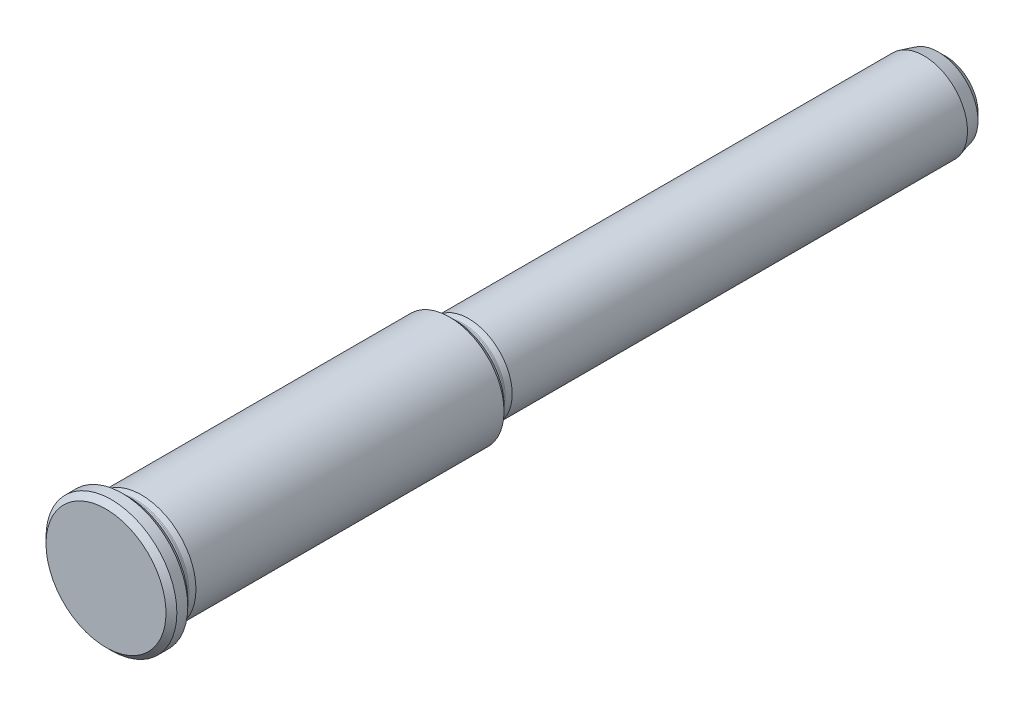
ISO-10303-21;
HEADER;
FILE_DESCRIPTION(('STEP AP214'),'2;1');
FILE_NAME('part.step','',(''),(''),'','','');
FILE_SCHEMA(('AUTOMOTIVE_DESIGN { 1 0 10303 214 1 1 1 1 }'));
ENDSEC;
DATA;
#1=APPLICATION_CONTEXT('core data for automotive mechanical design processes');
#2=APPLICATION_PROTOCOL_DEFINITION('international standard','automotive_design',2000,#1);
#3=PRODUCT_CONTEXT('',#1,'mechanical');
#4=PRODUCT('Part','Part','',(#3));
#5=PRODUCT_RELATED_PRODUCT_CATEGORY('part','',(#4));
#6=PRODUCT_DEFINITION_FORMATION('','',#4);
#7=PRODUCT_DEFINITION_CONTEXT('part definition',#1,'design');
#8=PRODUCT_DEFINITION('design','',#6,#7);
#9=PRODUCT_DEFINITION_SHAPE('','',#8);
#10=(LENGTH_UNIT() NAMED_UNIT(*) SI_UNIT(.MILLI.,.METRE.));
#11=(NAMED_UNIT(*) PLANE_ANGLE_UNIT() SI_UNIT($,.RADIAN.));
#12=(NAMED_UNIT(*) SI_UNIT($,.STERADIAN.) SOLID_ANGLE_UNIT());
#13=UNCERTAINTY_MEASURE_WITH_UNIT(LENGTH_MEASURE(1.E-05),#10,'distance_accuracy_value','');
#14=(GEOMETRIC_REPRESENTATION_CONTEXT(3) GLOBAL_UNCERTAINTY_ASSIGNED_CONTEXT((#13)) GLOBAL_UNIT_ASSIGNED_CONTEXT((#10,
#11,#12)) REPRESENTATION_CONTEXT('',''));
#15=CARTESIAN_POINT('',(0.,0.,0.));
#16=DIRECTION('',(0.,0.,1.));
#17=DIRECTION('',(1.,0.,0.));
#18=AXIS2_PLACEMENT_3D('',#15,#16,#17);
#19=CARTESIAN_POINT('',(0.,0.,0.));
#20=DIRECTION('',(0.,0.,-1.));
#21=DIRECTION('',(-1.,0.,0.));
#22=AXIS2_PLACEMENT_3D('',#19,#20,#21);
#23=PLANE('',#22);
#24=CARTESIAN_POINT('',(0.,0.,0.));
#25=DIRECTION('',(0.,0.,-1.));
#26=DIRECTION('',(-1.,0.,0.));
#27=AXIS2_PLACEMENT_3D('',#24,#25,#26);
#28=CIRCLE('',#27,11.);
#29=CARTESIAN_POINT('',(-11.,0.,0.));
#30=VERTEX_POINT('',#29);
#31=EDGE_CURVE('E9',#30,#30,#28,.F.);
#32=ORIENTED_EDGE('',*,*,#31,.T.);
#33=EDGE_LOOP('',(#32));
#34=FACE_BOUND('',#33,.T.);
#35=ADVANCED_FACE('F14',(#34),#23,.F.);
#36=CARTESIAN_POINT('',(0.,0.,0.));
#37=DIRECTION('',(0.,0.,1.));
#38=DIRECTION('',(1.,0.,0.));
#39=AXIS2_PLACEMENT_3D('',#36,#37,#38);
#40=CYLINDRICAL_SURFACE('',#39,12.);
#41=CARTESIAN_POINT('',(0.,0.,-3.));
#42=DIRECTION('',(0.,0.,1.));
#43=DIRECTION('',(1.,0.,0.));
#44=AXIS2_PLACEMENT_3D('',#41,#42,#43);
#45=CIRCLE('',#44,12.);
#46=CARTESIAN_POINT('',(12.,0.,-3.));
#47=VERTEX_POINT('',#46);
#48=EDGE_CURVE('E25',#47,#47,#45,.T.);
#49=ORIENTED_EDGE('',*,*,#48,.T.);
#50=EDGE_LOOP('',(#49));
#51=FACE_BOUND('',#50,.T.);
#52=CARTESIAN_POINT('',(0.,0.,-1.));
#53=DIRECTION('',(0.,0.,-1.));
#54=DIRECTION('',(-1.,0.,0.));
#55=AXIS2_PLACEMENT_3D('',#52,#53,#54);
#56=CIRCLE('',#55,12.);
#57=CARTESIAN_POINT('',(-12.,0.,-1.));
#58=VERTEX_POINT('',#57);
#59=EDGE_CURVE('E29',#58,#58,#56,.T.);
#60=ORIENTED_EDGE('',*,*,#59,.T.);
#61=EDGE_LOOP('',(#60));
#62=FACE_BOUND('',#61,.T.);
#63=ADVANCED_FACE('F100',(#51,#62),#40,.T.);
#64=CARTESIAN_POINT('',(0.,12.,-4.));
#65=DIRECTION('',(0.,0.,1.));
#66=DIRECTION('',(1.,0.,0.));
#67=AXIS2_PLACEMENT_3D('',#64,#65,#66);
#68=PLANE('',#67);
#69=CARTESIAN_POINT('',(0.,0.,-4.));
#70=DIRECTION('',(0.,0.,1.));
#71=DIRECTION('',(1.,0.,0.));
#72=AXIS2_PLACEMENT_3D('',#69,#70,#71);
#73=CIRCLE('',#72,11.);
#74=CARTESIAN_POINT('',(11.,0.,-4.));
#75=VERTEX_POINT('',#74);
#76=EDGE_CURVE('E21',#75,#75,#73,.F.);
#77=ORIENTED_EDGE('',*,*,#76,.T.);
#78=EDGE_LOOP('',(#77));
#79=FACE_BOUND('',#78,.T.);
#80=CARTESIAN_POINT('',(0.,0.,-4.));
#81=DIRECTION('',(0.,0.,1.));
#82=DIRECTION('',(1.,0.,0.));
#83=AXIS2_PLACEMENT_3D('',#80,#81,#82);
#84=CIRCLE('',#83,10.5);
#85=CARTESIAN_POINT('',(10.5,0.,-4.));
#86=VERTEX_POINT('',#85);
#87=EDGE_CURVE('E46',#86,#86,#84,.T.);
#88=ORIENTED_EDGE('',*,*,#87,.T.);
#89=EDGE_LOOP('',(#88));
#90=FACE_BOUND('',#89,.T.);
#91=ADVANCED_FACE('F106',(#79,#90),#68,.F.);
#92=CARTESIAN_POINT('',(0.,0.,-4.8));
#93=DIRECTION('',(0.,0.,1.));
#94=DIRECTION('',(1.,0.,0.));
#95=AXIS2_PLACEMENT_3D('',#92,#93,#94);
#96=TOROIDAL_SURFACE('',#95,10.5,0.8);
#97=ORIENTED_EDGE('',*,*,#87,.F.);
#98=EDGE_LOOP('',(#97));
#99=FACE_BOUND('',#98,.T.);
#100=CARTESIAN_POINT('',(0.,0.,-4.8));
#101=DIRECTION('',(0.,0.,1.));
#102=DIRECTION('',(1.,0.,0.));
#103=AXIS2_PLACEMENT_3D('',#100,#101,#102);
#104=CIRCLE('',#103,9.7);
#105=CARTESIAN_POINT('',(9.7,0.,-4.8));
#106=VERTEX_POINT('',#105);
#107=EDGE_CURVE('E49',#106,#106,#104,.T.);
#108=ORIENTED_EDGE('',*,*,#107,.T.);
#109=EDGE_LOOP('',(#108));
#110=FACE_BOUND('',#109,.T.);
#111=ADVANCED_FACE('F176',(#99,#110),#96,.F.);
#112=CARTESIAN_POINT('',(0.,0.,0.));
#113=DIRECTION('',(0.,0.,1.));
#114=DIRECTION('',(1.,0.,0.));
#115=AXIS2_PLACEMENT_3D('',#112,#113,#114);
#116=CYLINDRICAL_SURFACE('',#115,9.7);
#117=ORIENTED_EDGE('',*,*,#107,.F.);
#118=EDGE_LOOP('',(#117));
#119=FACE_BOUND('',#118,.T.);
#120=CARTESIAN_POINT('',(0.,0.,-5.27506275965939));
#121=DIRECTION('',(0.,0.,1.));
#122=DIRECTION('',(1.,0.,0.));
#123=AXIS2_PLACEMENT_3D('',#120,#121,#122);
#124=CIRCLE('',#123,9.7);
#125=CARTESIAN_POINT('',(9.7,0.,-5.27506275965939));
#126=VERTEX_POINT('',#125);
#127=EDGE_CURVE('E52',#126,#126,#124,.T.);
#128=ORIENTED_EDGE('',*,*,#127,.T.);
#129=EDGE_LOOP('',(#128));
#130=FACE_BOUND('',#129,.T.);
#131=ADVANCED_FACE('F232',(#119,#130),#116,.T.);
#132=CARTESIAN_POINT('',(0.,0.,-5.27506275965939));
#133=DIRECTION('',(0.,0.,1.));
#134=DIRECTION('',(1.,0.,0.));
#135=AXIS2_PLACEMENT_3D('',#132,#133,#134);
#136=TOROIDAL_SURFACE('',#135,10.5,0.8);
#137=ORIENTED_EDGE('',*,*,#127,.F.);
#138=EDGE_LOOP('',(#137));
#139=FACE_BOUND('',#138,.T.);
#140=CARTESIAN_POINT('',(0.,0.,-5.4821179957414));
#141=DIRECTION('',(0.,0.,1.));
#142=DIRECTION('',(1.,0.,0.));
#143=AXIS2_PLACEMENT_3D('',#140,#141,#142);
#144=CIRCLE('',#143,9.72725933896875);
#145=CARTESIAN_POINT('',(9.72725933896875,0.,-5.4821179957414));
#146=VERTEX_POINT('',#145);
#147=EDGE_CURVE('E55',#146,#146,#144,.T.);
#148=ORIENTED_EDGE('',*,*,#147,.T.);
#149=EDGE_LOOP('',(#148));
#150=FACE_BOUND('',#149,.T.);
#151=ADVANCED_FACE('F222',(#139,#150),#136,.F.);
#152=CARTESIAN_POINT('',(0.,0.,-6.5));
#153=DIRECTION('',(0.,0.,-1.));
#154=DIRECTION('',(-1.,0.,0.));
#155=AXIS2_PLACEMENT_3D('',#152,#153,#154);
#156=CONICAL_SURFACE('',#155,10.,0.261799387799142);
#157=ORIENTED_EDGE('',*,*,#147,.F.);
#158=EDGE_LOOP('',(#157));
#159=FACE_BOUND('',#158,.T.);
#160=CARTESIAN_POINT('',(0.,0.,-6.5));
#161=DIRECTION('',(0.,0.,1.));
#162=DIRECTION('',(1.,0.,0.));
#163=AXIS2_PLACEMENT_3D('',#160,#161,#162);
#164=CIRCLE('',#163,10.);
#165=CARTESIAN_POINT('',(10.,0.,-6.5));
#166=VERTEX_POINT('',#165);
#167=EDGE_CURVE('E58',#166,#166,#164,.T.);
#168=ORIENTED_EDGE('',*,*,#167,.T.);
#169=EDGE_LOOP('',(#168));
#170=FACE_BOUND('',#169,.T.);
#171=ADVANCED_FACE('F164',(#159,#170),#156,.T.);
#172=CARTESIAN_POINT('',(0.,0.,0.));
#173=DIRECTION('',(0.,0.,1.));
#174=DIRECTION('',(1.,0.,0.));
#175=AXIS2_PLACEMENT_3D('',#172,#173,#174);
#176=CYLINDRICAL_SURFACE('',#175,10.);
#177=CARTESIAN_POINT('',(0.,0.,-63.));
#178=DIRECTION('',(0.,0.,1.));
#179=DIRECTION('',(1.,0.,0.));
#180=AXIS2_PLACEMENT_3D('',#177,#178,#179);
#181=CIRCLE('',#180,10.);
#182=CARTESIAN_POINT('',(10.,0.,-63.));
#183=VERTEX_POINT('',#182);
#184=EDGE_CURVE('E37',#183,#183,#181,.T.);
#185=ORIENTED_EDGE('',*,*,#184,.T.);
#186=EDGE_LOOP('',(#185));
#187=FACE_BOUND('',#186,.T.);
#188=ORIENTED_EDGE('',*,*,#167,.F.);
#189=EDGE_LOOP('',(#188));
#190=FACE_BOUND('',#189,.T.);
#191=ADVANCED_FACE('F152',(#187,#190),#176,.T.);
#192=CARTESIAN_POINT('',(0.,10.,-64.));
#193=DIRECTION('',(0.,0.,1.));
#194=DIRECTION('',(1.,0.,0.));
#195=AXIS2_PLACEMENT_3D('',#192,#193,#194);
#196=PLANE('',#195);
#197=CARTESIAN_POINT('',(0.,0.,-64.));
#198=DIRECTION('',(0.,0.,1.));
#199=DIRECTION('',(1.,0.,0.));
#200=AXIS2_PLACEMENT_3D('',#197,#198,#199);
#201=CIRCLE('',#200,9.);
#202=CARTESIAN_POINT('',(9.,0.,-64.));
#203=VERTEX_POINT('',#202);
#204=EDGE_CURVE('E34',#203,#203,#201,.F.);
#205=ORIENTED_EDGE('',*,*,#204,.T.);
#206=EDGE_LOOP('',(#205));
#207=FACE_BOUND('',#206,.T.);
#208=CARTESIAN_POINT('',(0.,0.,-64.));
#209=DIRECTION('',(0.,0.,1.));
#210=DIRECTION('',(1.,0.,0.));
#211=AXIS2_PLACEMENT_3D('',#208,#209,#210);
#212=CIRCLE('',#211,8.5);
#213=CARTESIAN_POINT('',(8.5,0.,-64.));
#214=VERTEX_POINT('',#213);
#215=EDGE_CURVE('E61',#214,#214,#212,.T.);
#216=ORIENTED_EDGE('',*,*,#215,.T.);
#217=EDGE_LOOP('',(#216));
#218=FACE_BOUND('',#217,.T.);
#219=ADVANCED_FACE('F146',(#207,#218),#196,.F.);
#220=CARTESIAN_POINT('',(0.,0.,-64.8));
#221=DIRECTION('',(0.,0.,1.));
#222=DIRECTION('',(1.,0.,0.));
#223=AXIS2_PLACEMENT_3D('',#220,#221,#222);
#224=TOROIDAL_SURFACE('',#223,8.5,0.8);
#225=ORIENTED_EDGE('',*,*,#215,.F.);
#226=EDGE_LOOP('',(#225));
#227=FACE_BOUND('',#226,.T.);
#228=CARTESIAN_POINT('',(0.,0.,-64.8));
#229=DIRECTION('',(0.,0.,1.));
#230=DIRECTION('',(1.,0.,0.));
#231=AXIS2_PLACEMENT_3D('',#228,#229,#230);
#232=CIRCLE('',#231,7.7);
#233=CARTESIAN_POINT('',(7.7,0.,-64.8));
#234=VERTEX_POINT('',#233);
#235=EDGE_CURVE('E64',#234,#234,#232,.T.);
#236=ORIENTED_EDGE('',*,*,#235,.T.);
#237=EDGE_LOOP('',(#236));
#238=FACE_BOUND('',#237,.T.);
#239=ADVANCED_FACE('F151',(#227,#238),#224,.F.);
#240=CARTESIAN_POINT('',(0.,0.,0.));
#241=DIRECTION('',(0.,0.,1.));
#242=DIRECTION('',(1.,0.,0.));
#243=AXIS2_PLACEMENT_3D('',#240,#241,#242);
#244=CYLINDRICAL_SURFACE('',#243,7.7);
#245=ORIENTED_EDGE('',*,*,#235,.F.);
#246=EDGE_LOOP('',(#245));
#247=FACE_BOUND('',#246,.T.);
#248=CARTESIAN_POINT('',(0.,0.,-65.2750627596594));
#249=DIRECTION('',(0.,0.,1.));
#250=DIRECTION('',(1.,0.,0.));
#251=AXIS2_PLACEMENT_3D('',#248,#249,#250);
#252=CIRCLE('',#251,7.7);
#253=CARTESIAN_POINT('',(7.7,0.,-65.2750627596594));
#254=VERTEX_POINT('',#253);
#255=EDGE_CURVE('E67',#254,#254,#252,.T.);
#256=ORIENTED_EDGE('',*,*,#255,.T.);
#257=EDGE_LOOP('',(#256));
#258=FACE_BOUND('',#257,.T.);
#259=ADVANCED_FACE('F198',(#247,#258),#244,.T.);
#260=CARTESIAN_POINT('',(0.,0.,-65.2750627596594));
#261=DIRECTION('',(0.,0.,1.));
#262=DIRECTION('',(1.,0.,0.));
#263=AXIS2_PLACEMENT_3D('',#260,#261,#262);
#264=TOROIDAL_SURFACE('',#263,8.5,0.8);
#265=ORIENTED_EDGE('',*,*,#255,.F.);
#266=EDGE_LOOP('',(#265));
#267=FACE_BOUND('',#266,.T.);
#268=CARTESIAN_POINT('',(0.,0.,-65.4821179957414));
#269=DIRECTION('',(0.,0.,1.));
#270=DIRECTION('',(1.,0.,0.));
#271=AXIS2_PLACEMENT_3D('',#268,#269,#270);
#272=CIRCLE('',#271,7.72725933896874);
#273=CARTESIAN_POINT('',(7.72725933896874,0.,-65.4821179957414));
#274=VERTEX_POINT('',#273);
#275=EDGE_CURVE('E70',#274,#274,#272,.T.);
#276=ORIENTED_EDGE('',*,*,#275,.T.);
#277=EDGE_LOOP('',(#276));
#278=FACE_BOUND('',#277,.T.);
#279=ADVANCED_FACE('F187',(#267,#278),#264,.F.);
#280=CARTESIAN_POINT('',(0.,0.,-66.5));
#281=DIRECTION('',(0.,0.,-1.));
#282=DIRECTION('',(-1.,0.,0.));
#283=AXIS2_PLACEMENT_3D('',#280,#281,#282);
#284=CONICAL_SURFACE('',#283,8.,0.261799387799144);
#285=ORIENTED_EDGE('',*,*,#275,.F.);
#286=EDGE_LOOP('',(#285));
#287=FACE_BOUND('',#286,.T.);
#288=CARTESIAN_POINT('',(0.,0.,-66.5));
#289=DIRECTION('',(0.,0.,1.));
#290=DIRECTION('',(1.,0.,0.));
#291=AXIS2_PLACEMENT_3D('',#288,#289,#290);
#292=CIRCLE('',#291,8.);
#293=CARTESIAN_POINT('',(8.,0.,-66.5));
#294=VERTEX_POINT('',#293);
#295=EDGE_CURVE('E73',#294,#294,#292,.T.);
#296=ORIENTED_EDGE('',*,*,#295,.T.);
#297=EDGE_LOOP('',(#296));
#298=FACE_BOUND('',#297,.T.);
#299=ADVANCED_FACE('F96',(#287,#298),#284,.T.);
#300=CARTESIAN_POINT('',(0.,0.,0.));
#301=DIRECTION('',(0.,0.,1.));
#302=DIRECTION('',(1.,0.,0.));
#303=AXIS2_PLACEMENT_3D('',#300,#301,#302);
#304=CYLINDRICAL_SURFACE('',#303,8.);
#305=ORIENTED_EDGE('',*,*,#295,.F.);
#306=EDGE_LOOP('',(#305));
#307=FACE_BOUND('',#306,.T.);
#308=CARTESIAN_POINT('',(0.,0.,-150.));
#309=DIRECTION('',(0.,0.,1.));
#310=DIRECTION('',(1.,0.,0.));
#311=AXIS2_PLACEMENT_3D('',#308,#309,#310);
#312=CIRCLE('',#311,8.);
#313=CARTESIAN_POINT('',(8.,0.,-150.));
#314=VERTEX_POINT('',#313);
#315=EDGE_CURVE('E76',#314,#314,#312,.T.);
#316=ORIENTED_EDGE('',*,*,#315,.T.);
#317=EDGE_LOOP('',(#316));
#318=FACE_BOUND('',#317,.T.);
#319=ADVANCED_FACE('F80',(#307,#318),#304,.T.);
#320=CARTESIAN_POINT('',(0.,0.,-154.));
#321=DIRECTION('',(0.,0.,1.));
#322=DIRECTION('',(1.,0.,0.));
#323=AXIS2_PLACEMENT_3D('',#320,#321,#322);
#324=CONICAL_SURFACE('',#323,6.92820323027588,0.261799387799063);
#325=CARTESIAN_POINT('',(0.,0.,-152.633974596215));
#326=DIRECTION('',(0.,0.,-1.));
#327=DIRECTION('',(-1.,0.,0.));
#328=AXIS2_PLACEMENT_3D('',#325,#326,#327);
#329=CIRCLE('',#328,7.29422863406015);
#330=CARTESIAN_POINT('',(-7.29422863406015,0.,-152.633974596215));
#331=VERTEX_POINT('',#330);
#332=EDGE_CURVE('E43',#331,#331,#329,.F.);
#333=ORIENTED_EDGE('',*,*,#332,.T.);
#334=EDGE_LOOP('',(#333));
#335=FACE_BOUND('',#334,.T.);
#336=ORIENTED_EDGE('',*,*,#315,.F.);
#337=EDGE_LOOP('',(#336));
#338=FACE_BOUND('',#337,.T.);
#339=ADVANCED_FACE('F82',(#335,#338),#324,.T.);
#340=CARTESIAN_POINT('',(0.,6.92820323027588,-154.));
#341=DIRECTION('',(0.,0.,1.));
#342=DIRECTION('',(1.,0.,0.));
#343=AXIS2_PLACEMENT_3D('',#340,#341,#342);
#344=PLANE('',#343);
#345=CARTESIAN_POINT('',(0.,0.,-154.));
#346=DIRECTION('',(0.,0.,1.));
#347=DIRECTION('',(1.,0.,0.));
#348=AXIS2_PLACEMENT_3D('',#345,#346,#347);
#349=CIRCLE('',#348,5.92820323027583);
#350=CARTESIAN_POINT('',(5.92820323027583,0.,-154.));
#351=VERTEX_POINT('',#350);
#352=EDGE_CURVE('E40',#351,#351,#349,.F.);
#353=ORIENTED_EDGE('',*,*,#352,.T.);
#354=EDGE_LOOP('',(#353));
#355=FACE_BOUND('',#354,.T.);
#356=ADVANCED_FACE('F84',(#355),#344,.F.);
#357=CARTESIAN_POINT('',(0.,0.,-152.633974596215));
#358=DIRECTION('',(0.,0.,1.));
#359=DIRECTION('',(1.,0.,0.));
#360=AXIS2_PLACEMENT_3D('',#357,#358,#359);
#361=CONICAL_SURFACE('',#360,7.29422863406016,0.785398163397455);
#362=ORIENTED_EDGE('',*,*,#352,.F.);
#363=EDGE_LOOP('',(#362));
#364=FACE_BOUND('',#363,.T.);
#365=ORIENTED_EDGE('',*,*,#332,.F.);
#366=EDGE_LOOP('',(#365));
#367=FACE_BOUND('',#366,.T.);
#368=ADVANCED_FACE('F93',(#364,#367),#361,.T.);
#369=CARTESIAN_POINT('',(0.,0.,-63.));
#370=DIRECTION('',(0.,0.,1.));
#371=DIRECTION('',(1.,0.,0.));
#372=AXIS2_PLACEMENT_3D('',#369,#370,#371);
#373=CONICAL_SURFACE('',#372,10.,0.785398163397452);
#374=ORIENTED_EDGE('',*,*,#204,.F.);
#375=EDGE_LOOP('',(#374));
#376=FACE_BOUND('',#375,.T.);
#377=ORIENTED_EDGE('',*,*,#184,.F.);
#378=EDGE_LOOP('',(#377));
#379=FACE_BOUND('',#378,.T.);
#380=ADVANCED_FACE('F113',(#376,#379),#373,.T.);
#381=CARTESIAN_POINT('',(0.,0.,-3.));
#382=DIRECTION('',(0.,0.,1.));
#383=DIRECTION('',(1.,0.,0.));
#384=AXIS2_PLACEMENT_3D('',#381,#382,#383);
#385=CONICAL_SURFACE('',#384,12.,0.785398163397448);
#386=ORIENTED_EDGE('',*,*,#76,.F.);
#387=EDGE_LOOP('',(#386));
#388=FACE_BOUND('',#387,.T.);
#389=ORIENTED_EDGE('',*,*,#48,.F.);
#390=EDGE_LOOP('',(#389));
#391=FACE_BOUND('',#390,.T.);
#392=ADVANCED_FACE('F116',(#388,#391),#385,.T.);
#393=CARTESIAN_POINT('',(0.,0.,0.));
#394=DIRECTION('',(0.,0.,-1.));
#395=DIRECTION('',(-1.,0.,0.));
#396=AXIS2_PLACEMENT_3D('',#393,#394,#395);
#397=CONICAL_SURFACE('',#396,11.,0.785398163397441);
#398=ORIENTED_EDGE('',*,*,#59,.F.);
#399=EDGE_LOOP('',(#398));
#400=FACE_BOUND('',#399,.T.);
#401=ORIENTED_EDGE('',*,*,#31,.F.);
#402=EDGE_LOOP('',(#401));
#403=FACE_BOUND('',#402,.T.);
#404=ADVANCED_FACE('F16',(#400,#403),#397,.T.);
#405=CLOSED_SHELL('',(#35,#63,#91,#111,#131,#151,#171,#191,#219,#239,#259,#279,#299,#319,#339,
#356,#368,#380,#392,#404));
#406=MANIFOLD_SOLID_BREP('B1',#405);
#407=ADVANCED_BREP_SHAPE_REPRESENTATION('',(#18,#406),#14);
#408=SHAPE_DEFINITION_REPRESENTATION(#9,#407);
ENDSEC;
END-ISO-10303-21;
